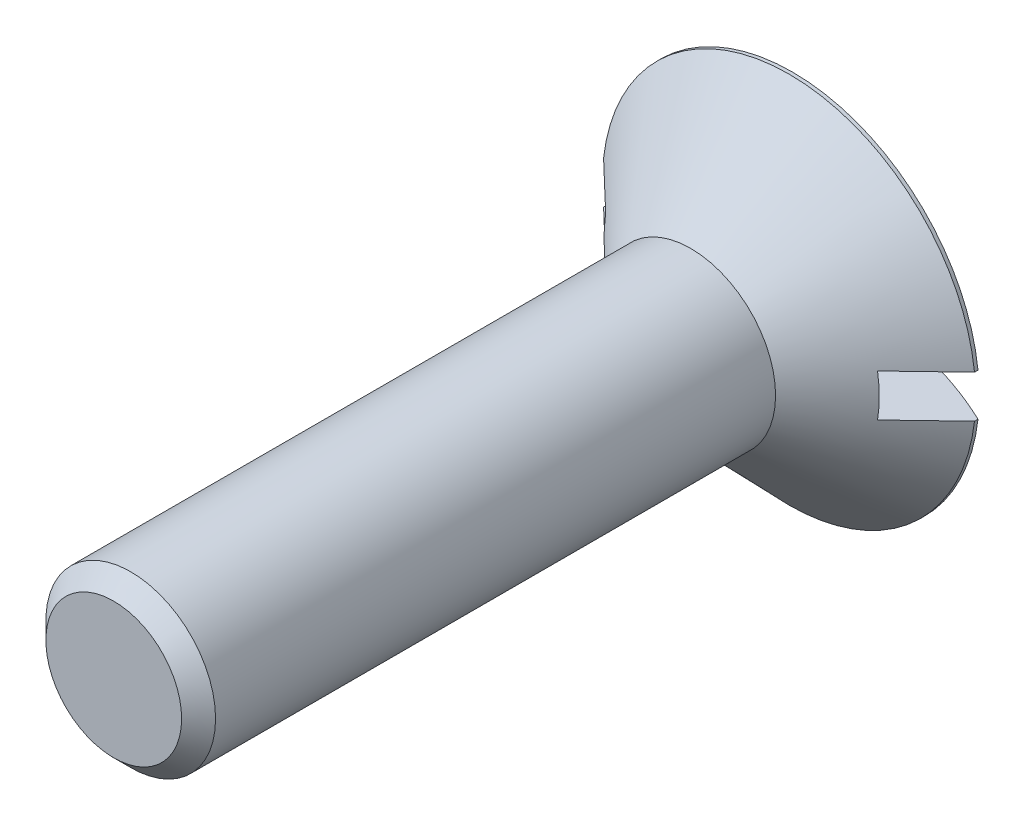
from build123d import *

# Parameters (mm, degrees)
FENTE1_DEPTH      = 4.3346664
FENTE1_DEPTH_BACK = 0.6
ESQUISSE2_W       = 4.4
ESQUISSE2_H       = 0.5
ESQUISSE3_W       = 1
ESQUISSE3_H       = 6.8
CHANFREIN1_SIZE   = 0.2


with BuildPart() as part:
    # Esquisse1 → Base-R_volution (revolve)
    with BuildSketch(Plane(origin=(0, 0, 0), x_dir=(1, 0, 0), z_dir=(0, 1, 0)), mode=Mode.PRIVATE) as base_r_volution_sk:
        with BuildLine():
            Line((1, 0), (2.2, 1.15882653))
            Line((2.2, 1.15882653), (2.2, 1.2))
            ThreePointArc((2.2, 1.2), (1.128051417, 1.573426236), (0, 1.7))
            Line((0, 1.7), (0, 1.2))
            Line((0, 1.2), (0, 0))
            Line((0, 0), (1, 0))
        make_face()
    revolve(base_r_volution_sk.sketch.rotate(Axis((0, 0, 0), (0, 0, -1)), 180), axis=Axis((0, 0, 0), (0, 0, -1)))

    # Esquisse2 → fente1 (cut, two sides: drawn at the far end of the back side and taken through both)
    with BuildSketch(Plane(origin=(0, 0, -1.2), x_dir=(-1, 0, 0), z_dir=(0, 0, -1)).offset(-FENTE1_DEPTH_BACK)):
        Rectangle(ESQUISSE2_W, ESQUISSE2_H)
    extrude(amount=FENTE1_DEPTH + FENTE1_DEPTH_BACK, mode=Mode.SUBTRACT)

    # Esquisse3 → Boss.-R_vol.1 (revolve)
    with BuildSketch(Plane(origin=(0, 0, 0), x_dir=(1, 0, 0), z_dir=(0, 1, 0)), mode=Mode.PRIVATE) as boss_r_vol_1_sk:
        with Locations((0.5, -3.4)):
            Rectangle(ESQUISSE3_W, ESQUISSE3_H)
    revolve(boss_r_vol_1_sk.sketch.rotate(Axis((0, 0, 0), (0, 0, 1)), 173.475021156), axis=Axis((0, 0, 0), (0, 0, 1)))

    # Chanfrein1
    chanfrein1_edges = [part.edges().sort_by_distance(p)[0] for p in [
        (0.993522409, -0.113636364, 6.8),
    ]]
    chamfer(chanfrein1_edges, length=CHANFREIN1_SIZE)


solid = part.part
